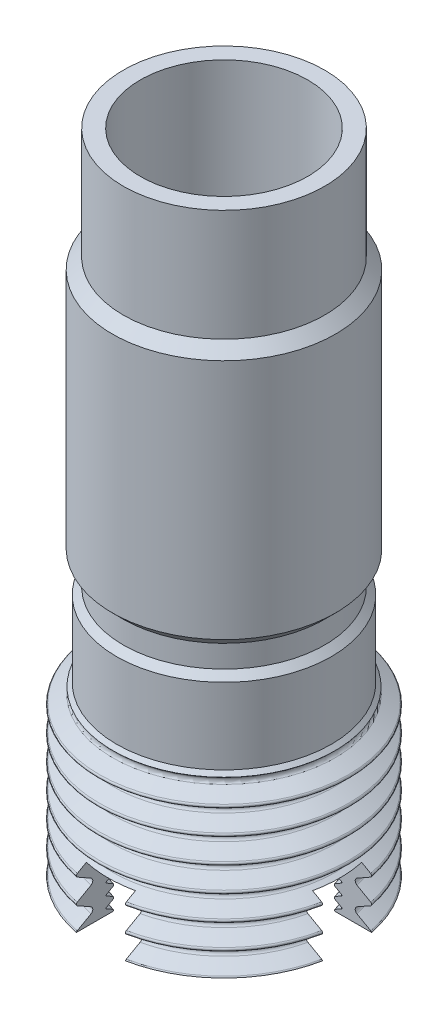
from build123d import *

# Parameters (mm, degrees)
LPATTERN1_COUNT = 7
LPATTERN1_PITCH = 1.4111111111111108
LPATTERN2_COUNT = 9
LPATTERN2_PITCH = 0.635
EXTRUDE1_DEPTH  = 3.175


with BuildPart() as part:
    # Sketch1 → Revolve1 (revolve)
    with BuildSketch(Plane.XY, mode=Mode.PRIVATE) as revolve1_sk:
        Polygon((-4.762500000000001, 1.19e-15), (-4.762500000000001, 15.875), (-2.4257, 15.875), (-2.4257, 23.995908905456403), (-4.7625, 25.4), (-4.7625, 36.82999999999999), (-5.727699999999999, 36.82999999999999), (-5.727699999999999, 30.479999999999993), (-6.35, 29.857699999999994), (-6.35, 16.1163), (-5.727699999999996, 15.493999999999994), (-5.727699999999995, 14.223999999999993), (-6.1087, 13.842999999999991), (-6.1087, 9.524999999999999), (-7.14375, 8.489950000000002), (-7.143750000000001, -2.9e-16), align=None)
    revolve(revolve1_sk.sketch.rotate(Axis((0, 0, 0), (0, 1, 0)), 270), axis=Axis((0, 0, 0), (0, 1, 0)))

    # Sketch3 → Outer thread (revolve, cut)
    with BuildSketch(Plane.XY):
        with BuildLine():
            Line((-7.092830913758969, 8.526638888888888), (-6.329044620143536, 8.96761111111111))
            ThreePointArc((-6.329044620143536, 8.96761111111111), (-6.2272064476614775, 9.144), (-6.329044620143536, 9.320388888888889))
            Line((-6.329044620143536, 9.320388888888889), (-7.092830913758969, 9.76136111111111))
            ThreePointArc((-7.092830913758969, 9.76136111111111), (-7.130106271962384, 9.798636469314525), (-7.143749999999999, 9.849555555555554))
            Line((-7.143749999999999, 9.849555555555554), (-7.143749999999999, 8.438444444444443))
            ThreePointArc((-7.143749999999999, 8.438444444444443), (-7.130106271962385, 8.489363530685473), (-7.092830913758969, 8.526638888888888))
        make_face()
    outer_thread = revolve(axis=Axis((0, 0, 0), (1.2e-16, -1, 0)), mode=Mode.SUBTRACT)

    # LPattern1: Outer thread ×7
    with Locations(*[(0, -i * LPATTERN1_PITCH, 0) for i in range(1, LPATTERN1_COUNT)]):
        add(outer_thread, mode=Mode.SUBTRACT)

    # Sketch4 → Inner thread (revolve, cut)
    with BuildSketch(Plane.XY):
        with BuildLine():
            Line((-5.125827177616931, 5.187949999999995), (-5.469531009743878, 5.3863875))
            ThreePointArc((-5.469531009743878, 5.3863875), (-5.492444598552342, 5.426075), (-5.469531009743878, 5.4657625))
            Line((-5.469531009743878, 5.4657625), (-5.125827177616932, 5.664199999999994))
            ThreePointArc((-5.125827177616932, 5.664199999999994), (-5.092279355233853, 5.69774782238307), (-5.08, 5.743575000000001))
            Line((-5.08, 5.743575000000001), (-5.079999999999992, 6.349999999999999))
            Line((-5.079999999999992, 6.349999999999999), (0, 15.148818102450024))
            Line((0, 15.148818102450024), (0, 0))
            Line((0, 0), (-5.08, -8.7e-16))
            Line((-5.08, -8.7e-16), (-5.08, 5.108575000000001))
            ThreePointArc((-5.08, 5.108575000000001), (-5.092279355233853, 5.1544021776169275), (-5.125827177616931, 5.187949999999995))
        make_face()
    inner_thread = revolve(axis=Axis((0, 15.44792506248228, 0), (0, -1, 0)), mode=Mode.SUBTRACT)

    # LPattern2: Inner thread ×9
    with Locations(*[(0, -i * LPATTERN2_PITCH, 0) for i in range(1, LPATTERN2_COUNT)]):
        add(inner_thread, mode=Mode.SUBTRACT)

    # Sketch2 → Extrude1 (cut)
    with BuildSketch(Plane.XZ):
        Polygon((1.3970000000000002, 1.3969999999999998), (9.323595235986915, 1.3969999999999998), (9.323595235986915, -1.3970000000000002), (1.3970000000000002, -1.3970000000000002), (1.397, -8.972892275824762), (-1.397, -8.972892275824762), (-1.3969999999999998, -1.3970000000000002), (-11.305988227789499, -1.3970000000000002), (-11.305988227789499, 1.3969999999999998), (-1.3969999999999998, 1.3969999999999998), (-1.3969999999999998, 9.3254258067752), (1.3970000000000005, 9.3254258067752), align=None)
    extrude(amount=-EXTRUDE1_DEPTH, mode=Mode.SUBTRACT)


solid = part.part
